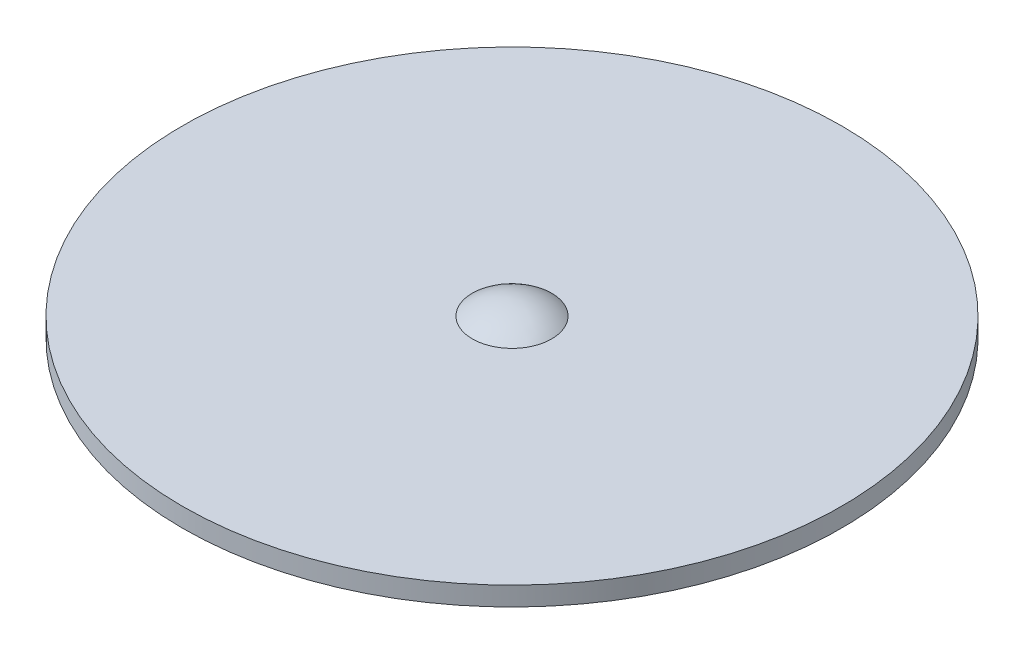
ISO-10303-21;
HEADER;
FILE_DESCRIPTION(('STEP AP214'),'2;1');
FILE_NAME('part.step','',(''),(''),'','','');
FILE_SCHEMA(('AUTOMOTIVE_DESIGN { 1 0 10303 214 1 1 1 1 }'));
ENDSEC;
DATA;
#1=APPLICATION_CONTEXT('core data for automotive mechanical design processes');
#2=APPLICATION_PROTOCOL_DEFINITION('international standard','automotive_design',2000,#1);
#3=PRODUCT_CONTEXT('',#1,'mechanical');
#4=PRODUCT('Part','Part','',(#3));
#5=PRODUCT_RELATED_PRODUCT_CATEGORY('part','',(#4));
#6=PRODUCT_DEFINITION_FORMATION('','',#4);
#7=PRODUCT_DEFINITION_CONTEXT('part definition',#1,'design');
#8=PRODUCT_DEFINITION('design','',#6,#7);
#9=PRODUCT_DEFINITION_SHAPE('','',#8);
#10=(LENGTH_UNIT() NAMED_UNIT(*) SI_UNIT(.MILLI.,.METRE.));
#11=(NAMED_UNIT(*) PLANE_ANGLE_UNIT() SI_UNIT($,.RADIAN.));
#12=(NAMED_UNIT(*) SI_UNIT($,.STERADIAN.) SOLID_ANGLE_UNIT());
#13=UNCERTAINTY_MEASURE_WITH_UNIT(LENGTH_MEASURE(1.E-05),#10,'distance_accuracy_value','');
#14=(GEOMETRIC_REPRESENTATION_CONTEXT(3) GLOBAL_UNCERTAINTY_ASSIGNED_CONTEXT((#13)) GLOBAL_UNIT_ASSIGNED_CONTEXT((#10,
#11,#12)) REPRESENTATION_CONTEXT('',''));
#15=CARTESIAN_POINT('',(0.,0.,0.));
#16=DIRECTION('',(0.,0.,1.));
#17=DIRECTION('',(1.,0.,0.));
#18=AXIS2_PLACEMENT_3D('',#15,#16,#17);
#19=CARTESIAN_POINT('',(0.,-2.42839752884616,0.));
#20=DIRECTION('',(-1.,0.,0.));
#21=DIRECTION('',(0.,-1.,0.));
#22=AXIS2_PLACEMENT_3D('',#19,#20,#21);
#23=SPHERICAL_SURFACE('',#22,3.08879752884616);
#24=CARTESIAN_POINT('',(-1.90881,0.,0.));
#25=CARTESIAN_POINT('',(-1.90880967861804,0.,0.0535933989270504));
#26=CARTESIAN_POINT('',(-1.90655087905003,0.,0.107196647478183));
#27=CARTESIAN_POINT('',(-1.89753037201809,0.,0.21403271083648));
#28=CARTESIAN_POINT('',(-1.89076733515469,0.,0.267265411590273));
#29=CARTESIAN_POINT('',(-1.87276876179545,0.,0.373061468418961));
#30=CARTESIAN_POINT('',(-1.86152612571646,2.98682092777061E-13,0.425623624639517));
#31=CARTESIAN_POINT('',(-1.83464592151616,-2.98924980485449E-13,0.52964318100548));
#32=CARTESIAN_POINT('',(-1.81900478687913,-1.11617234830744E-12,0.581099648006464));
#33=CARTESIAN_POINT('',(-1.76569948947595,-2.00503749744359E-12,0.733039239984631));
#34=CARTESIAN_POINT('',(-1.72160965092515,-5.25105525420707E-13,0.831348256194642));
#35=CARTESIAN_POINT('',(-1.61753012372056,5.25125489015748E-13,1.01915654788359));
#36=CARTESIAN_POINT('',(-1.55753983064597,0.,1.10865548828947));
#37=CARTESIAN_POINT('',(-1.45698659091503,0.,1.23435696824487));
#38=CARTESIAN_POINT('',(-1.42168099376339,0.,1.2748566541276));
#39=CARTESIAN_POINT('',(-1.3478232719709,0.,1.35270278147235));
#40=CARTESIAN_POINT('',(-1.30927431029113,0.,1.39005222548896));
#41=CARTESIAN_POINT('',(-1.18907055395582,0.,1.49704843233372));
#42=CARTESIAN_POINT('',(-1.10283709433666,0.,1.56167025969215));
#43=CARTESIAN_POINT('',(-0.920791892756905,0.,1.67548098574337));
#44=CARTESIAN_POINT('',(-0.824980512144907,0.,1.72467046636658));
#45=CARTESIAN_POINT('',(-0.626448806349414,0.,1.80627493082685));
#46=CARTESIAN_POINT('',(-0.523728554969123,-1.0073434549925E-13,1.83869009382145));
#47=CARTESIAN_POINT('',(-0.314306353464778,0.,1.88581255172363));
#48=CARTESIAN_POINT('',(-0.207604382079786,0.,1.90051975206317));
#49=CARTESIAN_POINT('',(0.00675425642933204,0.,1.91181308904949));
#50=CARTESIAN_POINT('',(0.114410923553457,0.,1.90839922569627));
#51=CARTESIAN_POINT('',(0.327625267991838,0.,1.8835430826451));
#52=CARTESIAN_POINT('',(0.43318295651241,0.,1.86210089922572));
#53=CARTESIAN_POINT('',(0.639190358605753,0.,1.80180929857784));
#54=CARTESIAN_POINT('',(0.739640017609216,0.,1.76295969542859));
#55=CARTESIAN_POINT('',(0.932636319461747,0.,1.66890777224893));
#56=CARTESIAN_POINT('',(1.0251826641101,0.,1.6137048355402));
#57=CARTESIAN_POINT('',(1.15596382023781,0.,1.51993159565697));
#58=CARTESIAN_POINT('',(1.19822394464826,0.,1.48683952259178));
#59=CARTESIAN_POINT('',(1.27985263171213,0.,1.4171850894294));
#60=CARTESIAN_POINT('',(1.31921836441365,0.,1.38061941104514));
#61=CARTESIAN_POINT('',(1.4324232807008,0.,1.2661796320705));
#62=CARTESIAN_POINT('',(1.5014857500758,0.,1.18347974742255));
#63=CARTESIAN_POINT('',(1.62472342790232,0.,1.00764750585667));
#64=CARTESIAN_POINT('',(1.67889920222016,0.,0.914515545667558));
#65=CARTESIAN_POINT('',(1.74787475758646,0.,0.769018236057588));
#66=CARTESIAN_POINT('',(1.76883619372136,0.,0.719490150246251));
#67=CARTESIAN_POINT('',(1.80649765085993,0.,0.618870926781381));
#68=CARTESIAN_POINT('',(1.82320112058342,0.,0.567781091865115));
#69=CARTESIAN_POINT('',(1.85221678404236,0.,0.464461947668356));
#70=CARTESIAN_POINT('',(1.86453591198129,0.,0.412234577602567));
#71=CARTESIAN_POINT('',(1.88473249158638,0.,0.306937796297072));
#72=CARTESIAN_POINT('',(1.89261125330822,0.,0.253868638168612));
#73=CARTESIAN_POINT('',(1.90176255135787,0.,0.167264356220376));
#74=CARTESIAN_POINT('',(1.90440450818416,0.,0.133867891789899));
#75=CARTESIAN_POINT('',(1.90792833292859,0.,0.0669822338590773));
#76=CARTESIAN_POINT('',(1.90881020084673,0.,0.0334930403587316));
#77=CARTESIAN_POINT('',(1.90880967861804,0.,-0.0535933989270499));
#78=CARTESIAN_POINT('',(1.90655087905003,0.,-0.107196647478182));
#79=CARTESIAN_POINT('',(1.8975303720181,0.,-0.21403271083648));
#80=CARTESIAN_POINT('',(1.89076733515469,0.,-0.267265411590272));
#81=CARTESIAN_POINT('',(1.87276876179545,0.,-0.37306146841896));
#82=CARTESIAN_POINT('',(1.86152612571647,2.9867426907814E-13,-0.425623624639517));
#83=CARTESIAN_POINT('',(1.83464592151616,-2.98917150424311E-13,-0.52964318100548));
#84=CARTESIAN_POINT('',(1.81900478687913,-1.11614311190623E-12,-0.581099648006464));
#85=CARTESIAN_POINT('',(1.76569948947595,-2.00509583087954E-12,-0.733039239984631));
#86=CARTESIAN_POINT('',(1.72160965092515,-5.25423798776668E-13,-0.831348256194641));
#87=CARTESIAN_POINT('',(1.61753012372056,5.25443774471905E-13,-1.01915654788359));
#88=CARTESIAN_POINT('',(1.55753983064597,0.,-1.10865548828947));
#89=CARTESIAN_POINT('',(1.45698659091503,0.,-1.23435696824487));
#90=CARTESIAN_POINT('',(1.42168099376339,0.,-1.2748566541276));
#91=CARTESIAN_POINT('',(1.3478232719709,0.,-1.35270278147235));
#92=CARTESIAN_POINT('',(1.30927431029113,0.,-1.39005222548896));
#93=CARTESIAN_POINT('',(1.18907055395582,0.,-1.49704843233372));
#94=CARTESIAN_POINT('',(1.10283709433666,0.,-1.56167025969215));
#95=CARTESIAN_POINT('',(0.920791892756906,0.,-1.67548098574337));
#96=CARTESIAN_POINT('',(0.824980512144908,0.,-1.72467046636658));
#97=CARTESIAN_POINT('',(0.626448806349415,0.,-1.80627493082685));
#98=CARTESIAN_POINT('',(0.523728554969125,-1.01725289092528E-13,-1.83869009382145));
#99=CARTESIAN_POINT('',(0.31430635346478,0.,-1.88581255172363));
#100=CARTESIAN_POINT('',(0.207604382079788,0.,-1.90051975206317));
#101=CARTESIAN_POINT('',(-0.0067542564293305,0.,-1.91181308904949));
#102=CARTESIAN_POINT('',(-0.114410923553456,0.,-1.90839922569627));
#103=CARTESIAN_POINT('',(-0.327625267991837,0.,-1.8835430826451));
#104=CARTESIAN_POINT('',(-0.433182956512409,0.,-1.86210089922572));
#105=CARTESIAN_POINT('',(-0.639190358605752,0.,-1.80180929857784));
#106=CARTESIAN_POINT('',(-0.739640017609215,0.,-1.76295969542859));
#107=CARTESIAN_POINT('',(-0.932636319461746,0.,-1.66890777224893));
#108=CARTESIAN_POINT('',(-1.0251826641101,0.,-1.6137048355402));
#109=CARTESIAN_POINT('',(-1.15596382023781,0.,-1.51993159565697));
#110=CARTESIAN_POINT('',(-1.19822394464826,0.,-1.48683952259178));
#111=CARTESIAN_POINT('',(-1.27985263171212,0.,-1.4171850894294));
#112=CARTESIAN_POINT('',(-1.31921836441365,0.,-1.38061941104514));
#113=CARTESIAN_POINT('',(-1.4324232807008,0.,-1.2661796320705));
#114=CARTESIAN_POINT('',(-1.5014857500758,0.,-1.18347974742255));
#115=CARTESIAN_POINT('',(-1.62472342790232,0.,-1.00764750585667));
#116=CARTESIAN_POINT('',(-1.67889920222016,0.,-0.914515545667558));
#117=CARTESIAN_POINT('',(-1.74787475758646,0.,-0.769018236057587));
#118=CARTESIAN_POINT('',(-1.76883619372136,0.,-0.71949015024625));
#119=CARTESIAN_POINT('',(-1.80649765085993,0.,-0.61887092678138));
#120=CARTESIAN_POINT('',(-1.82320112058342,0.,-0.567781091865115));
#121=CARTESIAN_POINT('',(-1.85221678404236,0.,-0.464461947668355));
#122=CARTESIAN_POINT('',(-1.86453591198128,0.,-0.412234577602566));
#123=CARTESIAN_POINT('',(-1.88473249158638,0.,-0.306937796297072));
#124=CARTESIAN_POINT('',(-1.89261125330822,0.,-0.253868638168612));
#125=CARTESIAN_POINT('',(-1.90176255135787,0.,-0.167264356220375));
#126=CARTESIAN_POINT('',(-1.90440450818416,0.,-0.133867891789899));
#127=CARTESIAN_POINT('',(-1.90792833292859,0.,-0.0669822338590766));
#128=CARTESIAN_POINT('',(-1.90881020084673,0.,-0.033493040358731));
#129=CARTESIAN_POINT('',(-1.90881,0.,0.));
#130=B_SPLINE_CURVE_WITH_KNOTS('',3,(#24,#25,#26,#27,#28,#29,#30,#31,#32,#33,#34,#35,#36,#37,
#38,#39,#40,#41,#42,#43,#44,#45,#46,#47,#48,#49,#50,#51,#52,#53,#54,#55,#56,#57,#58,#59,#60,#61,
#62,#63,#64,#65,#66,#67,#68,#69,#70,#71,#72,#73,#74,#75,#76,#77,#78,#79,#80,#81,#82,#83,#84,#85,
#86,#87,#88,#89,#90,#91,#92,#93,#94,#95,#96,#97,#98,#99,#100,#101,#102,#103,#104,#105,#106,#107,
#108,#109,#110,#111,#112,#113,#114,#115,#116,#117,#118,#119,#120,#121,#122,#123,#124,#125,#126,
#127,#128,#129),.UNSPECIFIED.,.T.,.F.,(4,2,2,2,2,2,2,2,2,2,2,2,2,2,2,2,2,2,2,2,2,2,2,2,2,2,2,2,
2,2,2,2,2,2,2,2,2,2,2,2,2,2,2,2,2,2,2,2,2,2,2,2,4),(0.,0.160749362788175,0.321546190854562,
0.482598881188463,0.643782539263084,0.965381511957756,1.28699271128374,1.44800902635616,
1.60887009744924,1.93048903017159,2.25209583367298,2.57369920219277,2.89530428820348,
3.21690937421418,3.53851274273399,3.86011954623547,4.18173847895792,4.34259955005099,
4.50361586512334,4.82522706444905,5.14682603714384,5.30800969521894,5.46906238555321,
5.6298592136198,5.79060857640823,5.89106842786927,5.99152827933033,6.1522776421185,
6.31307447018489,6.47412716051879,6.63531081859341,6.95690979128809,7.27852099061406,
7.43953730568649,7.60039837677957,7.92201730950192,8.2436241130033,8.5652274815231,
8.88683256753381,9.20843765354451,9.53004102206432,9.8516478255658,10.1732667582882,
10.3341278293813,10.4951441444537,10.8167553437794,11.1383543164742,11.2995379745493,
11.4605906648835,11.6213874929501,11.7821368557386,11.8825967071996,11.9830565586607),.UNSPECIFIED.);
#131=CARTESIAN_POINT('',(-1.90881,0.,0.));
#132=VERTEX_POINT('',#131);
#133=EDGE_CURVE('E20',#132,#132,#130,.T.);
#134=ORIENTED_EDGE('',*,*,#133,.T.);
#135=EDGE_LOOP('',(#134));
#136=FACE_BOUND('',#135,.T.);
#137=ADVANCED_FACE('F15',(#136),#23,.T.);
#138=CARTESIAN_POINT('',(-15.875,0.,0.));
#139=DIRECTION('',(0.,-1.,0.));
#140=DIRECTION('',(0.,0.,-1.));
#141=AXIS2_PLACEMENT_3D('',#138,#139,#140);
#142=PLANE('',#141);
#143=CARTESIAN_POINT('',(0.,0.,0.));
#144=DIRECTION('',(0.,1.,0.));
#145=DIRECTION('',(0.,0.,1.));
#146=AXIS2_PLACEMENT_3D('',#143,#144,#145);
#147=CIRCLE('',#146,15.875);
#148=CARTESIAN_POINT('',(0.,0.,15.875));
#149=VERTEX_POINT('',#148);
#150=EDGE_CURVE('E32',#149,#149,#147,.F.);
#151=ORIENTED_EDGE('',*,*,#150,.F.);
#152=EDGE_LOOP('',(#151));
#153=FACE_BOUND('',#152,.T.);
#154=ORIENTED_EDGE('',*,*,#133,.F.);
#155=EDGE_LOOP('',(#154));
#156=FACE_BOUND('',#155,.T.);
#157=ADVANCED_FACE('F54',(#153,#156),#142,.F.);
#158=CARTESIAN_POINT('',(0.,-2.42839752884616,0.));
#159=DIRECTION('',(-1.,0.,0.));
#160=DIRECTION('',(0.,-1.,0.));
#161=AXIS2_PLACEMENT_3D('',#158,#159,#160);
#162=SPHERICAL_SURFACE('',#161,2.17439752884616);
#163=CARTESIAN_POINT('',(-1.56071012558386,-0.9144,0.));
#164=CARTESIAN_POINT('',(-1.56070516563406,-0.914400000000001,0.0876005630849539));
#165=CARTESIAN_POINT('',(-1.55329418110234,-0.9144,0.175357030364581));
#166=CARTESIAN_POINT('',(-1.53124189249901,-0.9144,0.305048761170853));
#167=CARTESIAN_POINT('',(-1.52204926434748,-0.9144,0.348010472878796));
#168=CARTESIAN_POINT('',(-1.50007087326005,-0.9144,0.433049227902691));
#169=CARTESIAN_POINT('',(-1.48728219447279,-0.9144,0.475125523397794));
#170=CARTESIAN_POINT('',(-1.44369801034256,-0.914400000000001,0.599362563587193));
#171=CARTESIAN_POINT('',(-1.40764856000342,-0.914400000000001,0.679740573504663));
#172=CARTESIAN_POINT('',(-1.32254944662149,-0.914399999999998,0.833297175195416));
#173=CARTESIAN_POINT('',(-1.27349928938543,-0.914399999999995,0.906475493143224));
#174=CARTESIAN_POINT('',(-1.19128343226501,-0.914400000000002,1.00925372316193));
#175=CARTESIAN_POINT('',(-1.16241633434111,-0.914400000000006,1.04236762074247));
#176=CARTESIAN_POINT('',(-1.10202766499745,-0.914399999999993,1.10601729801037));
#177=CARTESIAN_POINT('',(-1.0705086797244,-0.914399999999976,1.13655553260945));
#178=CARTESIAN_POINT('',(-0.972225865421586,-0.914400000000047,1.2240394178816));
#179=CARTESIAN_POINT('',(-0.901718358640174,-0.914400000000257,1.2768764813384));
#180=CARTESIAN_POINT('',(-0.752871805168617,-0.914400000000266,1.36993212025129));
#181=CARTESIAN_POINT('',(-0.674533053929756,-0.914400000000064,1.41015117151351));
#182=CARTESIAN_POINT('',(-0.51220655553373,-0.914399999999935,1.47687385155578));
#183=CARTESIAN_POINT('',(-0.42821886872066,-0.914400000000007,1.50337762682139));
#184=CARTESIAN_POINT('',(-0.256987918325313,-0.914400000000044,1.54190660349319));
#185=CARTESIAN_POINT('',(-0.169744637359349,-0.914400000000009,1.55393172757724));
#186=CARTESIAN_POINT('',(0.0055225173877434,-0.91439999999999,1.56316555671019));
#187=CARTESIAN_POINT('',(0.0935463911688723,-0.914400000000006,1.56037426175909));
#188=CARTESIAN_POINT('',(0.267877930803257,-0.914400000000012,1.54005100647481));
#189=CARTESIAN_POINT('',(0.354185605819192,-0.914400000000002,1.52251912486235));
#190=CARTESIAN_POINT('',(0.522624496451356,-0.914399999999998,1.47322259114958));
#191=CARTESIAN_POINT('',(0.604755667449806,-0.914400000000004,1.44145778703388));
#192=CARTESIAN_POINT('',(0.76255622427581,-0.914400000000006,1.36455763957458));
#193=CARTESIAN_POINT('',(0.838225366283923,-0.914400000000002,1.31942179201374));
#194=CARTESIAN_POINT('',(0.945156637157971,-0.914399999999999,1.2427494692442));
#195=CARTESIAN_POINT('',(0.979710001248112,-0.914399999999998,1.2156922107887));
#196=CARTESIAN_POINT('',(1.04645247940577,-0.914400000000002,1.15874035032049));
#197=CARTESIAN_POINT('',(1.07863927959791,-0.914400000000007,1.12884303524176));
#198=CARTESIAN_POINT('',(1.17119962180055,-0.914400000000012,1.03527276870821));
#199=CARTESIAN_POINT('',(1.22766759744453,-0.914400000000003,0.967653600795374));
#200=CARTESIAN_POINT('',(1.32843087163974,-0.914399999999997,0.823889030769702));
#201=CARTESIAN_POINT('',(1.37272663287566,-0.914399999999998,0.747743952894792));
#202=CARTESIAN_POINT('',(1.42912399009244,-0.9144,0.628774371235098));
#203=CARTESIAN_POINT('',(1.44626312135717,-0.9144,0.588274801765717));
#204=CARTESIAN_POINT('',(1.47705545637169,-0.9144,0.506016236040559));
#205=CARTESIAN_POINT('',(1.4907114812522,-0.9144,0.464258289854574));
#206=CARTESIAN_POINT('',(1.52626930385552,-0.9144,0.337601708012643));
#207=CARTESIAN_POINT('',(1.54286044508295,-0.914399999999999,0.251109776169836));
#208=CARTESIAN_POINT('',(1.55495010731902,-0.914399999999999,0.136753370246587));
#209=CARTESIAN_POINT('',(1.5571082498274,-0.9144,0.109451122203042));
#210=CARTESIAN_POINT('',(1.55998903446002,-0.9144,0.0547709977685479));
#211=CARTESIAN_POINT('',(1.56071167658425,-0.9144,0.027393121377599));
#212=CARTESIAN_POINT('',(1.56070516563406,-0.9144,-0.0876005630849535));
#213=CARTESIAN_POINT('',(1.55329418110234,-0.9144,-0.17535703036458));
#214=CARTESIAN_POINT('',(1.53124189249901,-0.9144,-0.305048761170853));
#215=CARTESIAN_POINT('',(1.52204926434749,-0.9144,-0.348010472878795));
#216=CARTESIAN_POINT('',(1.50007087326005,-0.9144,-0.43304922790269));
#217=CARTESIAN_POINT('',(1.48728219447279,-0.9144,-0.475125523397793));
#218=CARTESIAN_POINT('',(1.44369801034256,-0.9144,-0.599362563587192));
#219=CARTESIAN_POINT('',(1.40764856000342,-0.914400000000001,-0.679740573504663));
#220=CARTESIAN_POINT('',(1.32254944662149,-0.914399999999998,-0.833297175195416));
#221=CARTESIAN_POINT('',(1.27349928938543,-0.914399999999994,-0.906475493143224));
#222=CARTESIAN_POINT('',(1.19128343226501,-0.914400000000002,-1.00925372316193));
#223=CARTESIAN_POINT('',(1.16241633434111,-0.914400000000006,-1.04236762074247));
#224=CARTESIAN_POINT('',(1.10202766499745,-0.914399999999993,-1.10601729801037));
#225=CARTESIAN_POINT('',(1.0705086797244,-0.914399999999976,-1.13655553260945));
#226=CARTESIAN_POINT('',(0.972225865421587,-0.914400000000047,-1.2240394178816));
#227=CARTESIAN_POINT('',(0.901718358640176,-0.914400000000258,-1.2768764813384));
#228=CARTESIAN_POINT('',(0.752871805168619,-0.914400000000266,-1.3699321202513));
#229=CARTESIAN_POINT('',(0.674533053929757,-0.914400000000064,-1.41015117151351));
#230=CARTESIAN_POINT('',(0.512206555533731,-0.914399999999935,-1.47687385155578));
#231=CARTESIAN_POINT('',(0.428218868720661,-0.914400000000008,-1.50337762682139));
#232=CARTESIAN_POINT('',(0.256987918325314,-0.914400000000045,-1.54190660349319));
#233=CARTESIAN_POINT('',(0.16974463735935,-0.91440000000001,-1.55393172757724));
#234=CARTESIAN_POINT('',(-0.00552251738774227,-0.91439999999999,-1.56316555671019));
#235=CARTESIAN_POINT('',(-0.0935463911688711,-0.914400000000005,-1.56037426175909));
#236=CARTESIAN_POINT('',(-0.267877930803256,-0.914400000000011,-1.54005100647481));
#237=CARTESIAN_POINT('',(-0.354185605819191,-0.914400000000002,-1.52251912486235));
#238=CARTESIAN_POINT('',(-0.522624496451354,-0.914399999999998,-1.47322259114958));
#239=CARTESIAN_POINT('',(-0.604755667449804,-0.914400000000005,-1.44145778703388));
#240=CARTESIAN_POINT('',(-0.762556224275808,-0.914400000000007,-1.36455763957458));
#241=CARTESIAN_POINT('',(-0.838225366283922,-0.914400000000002,-1.31942179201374));
#242=CARTESIAN_POINT('',(-0.94515663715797,-0.914399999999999,-1.2427494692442));
#243=CARTESIAN_POINT('',(-0.979710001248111,-0.914399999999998,-1.2156922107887));
#244=CARTESIAN_POINT('',(-1.04645247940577,-0.914400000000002,-1.15874035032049));
#245=CARTESIAN_POINT('',(-1.0786392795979,-0.914400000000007,-1.12884303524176));
#246=CARTESIAN_POINT('',(-1.17119962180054,-0.914400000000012,-1.03527276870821));
#247=CARTESIAN_POINT('',(-1.22766759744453,-0.914400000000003,-0.967653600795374));
#248=CARTESIAN_POINT('',(-1.32843087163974,-0.914399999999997,-0.823889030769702));
#249=CARTESIAN_POINT('',(-1.37272663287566,-0.914399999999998,-0.747743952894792));
#250=CARTESIAN_POINT('',(-1.42912399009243,-0.9144,-0.628774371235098));
#251=CARTESIAN_POINT('',(-1.44626312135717,-0.9144,-0.588274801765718));
#252=CARTESIAN_POINT('',(-1.47705545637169,-0.9144,-0.506016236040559));
#253=CARTESIAN_POINT('',(-1.4907114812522,-0.9144,-0.464258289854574));
#254=CARTESIAN_POINT('',(-1.52626930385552,-0.9144,-0.337601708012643));
#255=CARTESIAN_POINT('',(-1.54286044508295,-0.9144,-0.251109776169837));
#256=CARTESIAN_POINT('',(-1.55495010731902,-0.9144,-0.136753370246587));
#257=CARTESIAN_POINT('',(-1.5571082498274,-0.9144,-0.109451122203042));
#258=CARTESIAN_POINT('',(-1.55998903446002,-0.9144,-0.0547709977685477));
#259=CARTESIAN_POINT('',(-1.56071167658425,-0.9144,-0.0273931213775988));
#260=CARTESIAN_POINT('',(-1.56071012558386,-0.9144,0.));
#261=B_SPLINE_CURVE_WITH_KNOTS('',3,(#163,#164,#165,#166,#167,#168,#169,#170,#171,#172,#173,
#174,#175,#176,#177,#178,#179,#180,#181,#182,#183,#184,#185,#186,#187,#188,#189,#190,#191,#192,
#193,#194,#195,#196,#197,#198,#199,#200,#201,#202,#203,#204,#205,#206,#207,#208,#209,#210,#211,
#212,#213,#214,#215,#216,#217,#218,#219,#220,#221,#222,#223,#224,#225,#226,#227,#228,#229,#230,
#231,#232,#233,#234,#235,#236,#237,#238,#239,#240,#241,#242,#243,#244,#245,#246,#247,#248,#249,
#250,#251,#252,#253,#254,#255,#256,#257,#258,#259,#260),.UNSPECIFIED.,.T.,.F.,(4,2,2,2,2,2,2,2,
2,2,2,2,2,2,2,2,2,2,2,2,2,2,2,2,2,2,2,2,2,2,2,2,2,2,2,2,2,2,2,2,2,2,2,2,2,2,2,2,4),(0.,
0.262674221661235,0.394356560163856,0.526145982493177,0.789096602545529,1.05205721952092,
1.18370981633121,1.31523548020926,1.57820242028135,1.84115944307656,2.10411365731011,
2.36706927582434,2.63002489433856,2.89297910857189,3.15593613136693,3.41890307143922,
3.55042873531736,3.68208133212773,3.94504194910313,4.20799256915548,4.3397819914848,
4.47146432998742,4.73413855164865,4.81627805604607,4.89841756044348,5.16109178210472,
5.29277412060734,5.42456354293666,5.68751416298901,5.9504747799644,6.08212737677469,
6.21365304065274,6.47661998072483,6.73957700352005,7.00253121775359,7.26548683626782,
7.52844245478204,7.79139666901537,8.05435369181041,8.3173206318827,8.44884629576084,
8.58049889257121,8.84345950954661,9.10641012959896,9.23819955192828,9.3698818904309,
9.63255611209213,9.71469561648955,9.79683512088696),.UNSPECIFIED.);
#262=CARTESIAN_POINT('',(-1.56071012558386,-0.9144,0.));
#263=VERTEX_POINT('',#262);
#264=EDGE_CURVE('E27',#263,#263,#261,.T.);
#265=ORIENTED_EDGE('',*,*,#264,.F.);
#266=EDGE_LOOP('',(#265));
#267=FACE_BOUND('',#266,.T.);
#268=ADVANCED_FACE('F41',(#267),#162,.F.);
#269=CARTESIAN_POINT('',(0.,0.,0.));
#270=DIRECTION('',(0.,1.,0.));
#271=DIRECTION('',(0.,0.,1.));
#272=AXIS2_PLACEMENT_3D('',#269,#270,#271);
#273=CYLINDRICAL_SURFACE('',#272,15.875);
#274=CARTESIAN_POINT('',(0.,-0.9144,0.));
#275=DIRECTION('',(0.,1.,0.));
#276=DIRECTION('',(0.,0.,1.));
#277=AXIS2_PLACEMENT_3D('',#274,#275,#276);
#278=CIRCLE('',#277,15.875);
#279=CARTESIAN_POINT('',(0.,-0.9144,15.875));
#280=VERTEX_POINT('',#279);
#281=EDGE_CURVE('E9',#280,#280,#278,.F.);
#282=ORIENTED_EDGE('',*,*,#281,.F.);
#283=EDGE_LOOP('',(#282));
#284=FACE_BOUND('',#283,.T.);
#285=ORIENTED_EDGE('',*,*,#150,.T.);
#286=EDGE_LOOP('',(#285));
#287=FACE_BOUND('',#286,.T.);
#288=ADVANCED_FACE('F47',(#284,#287),#273,.T.);
#289=CARTESIAN_POINT('',(-15.875,-0.9144,0.));
#290=DIRECTION('',(0.,-1.,0.));
#291=DIRECTION('',(0.,0.,-1.));
#292=AXIS2_PLACEMENT_3D('',#289,#290,#291);
#293=PLANE('',#292);
#294=ORIENTED_EDGE('',*,*,#281,.T.);
#295=EDGE_LOOP('',(#294));
#296=FACE_BOUND('',#295,.T.);
#297=ORIENTED_EDGE('',*,*,#264,.T.);
#298=EDGE_LOOP('',(#297));
#299=FACE_BOUND('',#298,.T.);
#300=ADVANCED_FACE('F44',(#296,#299),#293,.T.);
#301=CLOSED_SHELL('',(#137,#157,#268,#288,#300));
#302=MANIFOLD_SOLID_BREP('B1',#301);
#303=ADVANCED_BREP_SHAPE_REPRESENTATION('',(#18,#302),#14);
#304=SHAPE_DEFINITION_REPRESENTATION(#9,#303);
ENDSEC;
END-ISO-10303-21;
